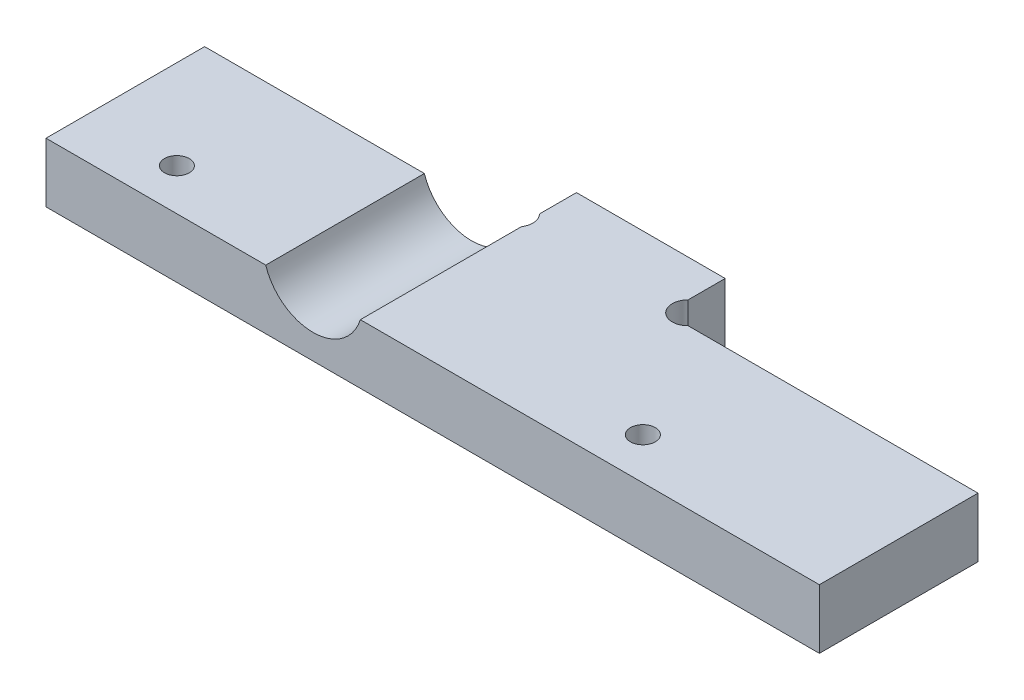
ISO-10303-21;
HEADER;
FILE_DESCRIPTION(('STEP AP214'),'2;1');
FILE_NAME('part.step','',(''),(''),'','','');
FILE_SCHEMA(('AUTOMOTIVE_DESIGN { 1 0 10303 214 1 1 1 1 }'));
ENDSEC;
DATA;
#1=APPLICATION_CONTEXT('core data for automotive mechanical design processes');
#2=APPLICATION_PROTOCOL_DEFINITION('international standard','automotive_design',2000,#1);
#3=PRODUCT_CONTEXT('',#1,'mechanical');
#4=PRODUCT('Part','Part','',(#3));
#5=PRODUCT_RELATED_PRODUCT_CATEGORY('part','',(#4));
#6=PRODUCT_DEFINITION_FORMATION('','',#4);
#7=PRODUCT_DEFINITION_CONTEXT('part definition',#1,'design');
#8=PRODUCT_DEFINITION('design','',#6,#7);
#9=PRODUCT_DEFINITION_SHAPE('','',#8);
#10=(LENGTH_UNIT() NAMED_UNIT(*) SI_UNIT(.MILLI.,.METRE.));
#11=(NAMED_UNIT(*) PLANE_ANGLE_UNIT() SI_UNIT($,.RADIAN.));
#12=(NAMED_UNIT(*) SI_UNIT($,.STERADIAN.) SOLID_ANGLE_UNIT());
#13=UNCERTAINTY_MEASURE_WITH_UNIT(LENGTH_MEASURE(1.E-05),#10,'distance_accuracy_value','');
#14=(GEOMETRIC_REPRESENTATION_CONTEXT(3) GLOBAL_UNCERTAINTY_ASSIGNED_CONTEXT((#13)) GLOBAL_UNIT_ASSIGNED_CONTEXT((#10,
#11,#12)) REPRESENTATION_CONTEXT('',''));
#15=CARTESIAN_POINT('',(0.,0.,0.));
#16=DIRECTION('',(0.,0.,1.));
#17=DIRECTION('',(1.,0.,0.));
#18=AXIS2_PLACEMENT_3D('',#15,#16,#17);
#19=CARTESIAN_POINT('',(30.3686291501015,6.,-17.1313708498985));
#20=DIRECTION('',(0.,1.,0.));
#21=DIRECTION('',(0.,0.,1.));
#22=AXIS2_PLACEMENT_3D('',#19,#20,#21);
#23=PLANE('',#22);
#24=DIRECTION('',(0.,0.,1.));
#25=VECTOR('',#24,1.);
#26=CARTESIAN_POINT('',(22.1641049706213,6.,-16.5));
#27=LINE('',#26,#25);
#28=CARTESIAN_POINT('',(22.1641049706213,6.,-16.));
#29=VERTEX_POINT('',#28);
#30=CARTESIAN_POINT('',(22.1641049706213,6.,0.));
#31=VERTEX_POINT('',#30);
#32=EDGE_CURVE('E53',#29,#31,#27,.T.);
#33=ORIENTED_EDGE('',*,*,#32,.F.);
#34=DIRECTION('',(-1.,0.,0.));
#35=VECTOR('',#34,1.);
#36=CARTESIAN_POINT('',(0.,6.,-16.));
#37=LINE('',#36,#35);
#38=CARTESIAN_POINT('',(0.,6.,-16.));
#39=VERTEX_POINT('',#38);
#40=EDGE_CURVE('E108',#29,#39,#37,.T.);
#41=ORIENTED_EDGE('',*,*,#40,.T.);
#42=DIRECTION('',(0.,0.,1.));
#43=VECTOR('',#42,1.);
#44=CARTESIAN_POINT('',(0.,6.,0.));
#45=LINE('',#44,#43);
#46=CARTESIAN_POINT('',(0.,6.,0.));
#47=VERTEX_POINT('',#46);
#48=EDGE_CURVE('E198',#39,#47,#45,.T.);
#49=ORIENTED_EDGE('',*,*,#48,.T.);
#50=DIRECTION('',(1.,0.,0.));
#51=VECTOR('',#50,1.);
#52=CARTESIAN_POINT('',(78.,6.,0.));
#53=LINE('',#52,#51);
#54=EDGE_CURVE('E220',#47,#31,#53,.T.);
#55=ORIENTED_EDGE('',*,*,#54,.T.);
#56=EDGE_LOOP('',(#33,#41,#49,#55));
#57=FACE_BOUND('',#56,.T.);
#58=CARTESIAN_POINT('',(9.,6.,-4.19999999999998));
#59=DIRECTION('',(0.,1.,0.));
#60=DIRECTION('',(0.,0.,1.));
#61=AXIS2_PLACEMENT_3D('',#58,#59,#60);
#62=CIRCLE('',#61,1.25);
#63=CARTESIAN_POINT('',(9.,6.,-2.94999999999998));
#64=VERTEX_POINT('',#63);
#65=EDGE_CURVE('E233',#64,#64,#62,.T.);
#66=ORIENTED_EDGE('',*,*,#65,.F.);
#67=EDGE_LOOP('',(#66));
#68=FACE_BOUND('',#67,.T.);
#69=ADVANCED_FACE('F37',(#57,#68),#23,.T.);
#70=DIRECTION('',(0.,0.,1.));
#71=VECTOR('',#70,1.);
#72=CARTESIAN_POINT('',(31.7034969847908,6.,-16.5));
#73=LINE('',#72,#71);
#74=CARTESIAN_POINT('',(31.7034969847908,6.,0.));
#75=VERTEX_POINT('',#74);
#76=CARTESIAN_POINT('',(31.7034969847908,6.,-16.2492552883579));
#77=VERTEX_POINT('',#76);
#78=EDGE_CURVE('E242',#75,#77,#73,.F.);
#79=ORIENTED_EDGE('',*,*,#78,.F.);
#80=CARTESIAN_POINT('',(78.,6.,0.));
#81=VERTEX_POINT('',#80);
#82=EDGE_CURVE('E224',#75,#81,#53,.T.);
#83=ORIENTED_EDGE('',*,*,#82,.T.);
#84=DIRECTION('',(0.,0.,-1.));
#85=VECTOR('',#84,1.);
#86=CARTESIAN_POINT('',(78.,6.,-16.));
#87=LINE('',#86,#85);
#88=CARTESIAN_POINT('',(78.,6.,-16.));
#89=VERTEX_POINT('',#88);
#90=EDGE_CURVE('E217',#81,#89,#87,.T.);
#91=ORIENTED_EDGE('',*,*,#90,.T.);
#92=DIRECTION('',(-1.,0.,0.));
#93=VECTOR('',#92,1.);
#94=CARTESIAN_POINT('',(48.7627416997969,6.,-16.));
#95=LINE('',#94,#93);
#96=CARTESIAN_POINT('',(48.7627416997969,6.,-16.));
#97=VERTEX_POINT('',#96);
#98=EDGE_CURVE('E219',#89,#97,#95,.T.);
#99=ORIENTED_EDGE('',*,*,#98,.T.);
#100=CARTESIAN_POINT('',(47.6313708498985,6.,-17.1313708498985));
#101=DIRECTION('',(0.,-1.,0.));
#102=DIRECTION('',(0.,0.,-1.));
#103=AXIS2_PLACEMENT_3D('',#100,#101,#102);
#104=CIRCLE('',#103,1.6);
#105=CARTESIAN_POINT('',(46.5,6.,-18.262741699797));
#106=VERTEX_POINT('',#105);
#107=EDGE_CURVE('E136',#97,#106,#104,.T.);
#108=ORIENTED_EDGE('',*,*,#107,.T.);
#109=DIRECTION('',(0.,0.,-1.));
#110=VECTOR('',#109,1.);
#111=CARTESIAN_POINT('',(46.5,6.,-22.));
#112=LINE('',#111,#110);
#113=CARTESIAN_POINT('',(46.5,6.,-22.));
#114=VERTEX_POINT('',#113);
#115=EDGE_CURVE('E127',#106,#114,#112,.T.);
#116=ORIENTED_EDGE('',*,*,#115,.T.);
#117=DIRECTION('',(-1.,0.,0.));
#118=VECTOR('',#117,1.);
#119=CARTESIAN_POINT('',(31.5,6.,-22.));
#120=LINE('',#119,#118);
#121=CARTESIAN_POINT('',(31.5,6.,-22.));
#122=VERTEX_POINT('',#121);
#123=EDGE_CURVE('E133',#114,#122,#120,.T.);
#124=ORIENTED_EDGE('',*,*,#123,.T.);
#125=DIRECTION('',(0.,0.,1.));
#126=VECTOR('',#125,1.);
#127=CARTESIAN_POINT('',(31.5,6.,-18.262741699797));
#128=LINE('',#127,#126);
#129=CARTESIAN_POINT('',(31.5,6.,-18.262741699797));
#130=VERTEX_POINT('',#129);
#131=EDGE_CURVE('E62',#122,#130,#128,.T.);
#132=ORIENTED_EDGE('',*,*,#131,.T.);
#133=CARTESIAN_POINT('',(30.3686291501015,6.,-17.1313708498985));
#134=DIRECTION('',(0.,-1.,0.));
#135=DIRECTION('',(0.,0.,1.));
#136=AXIS2_PLACEMENT_3D('',#133,#134,#135);
#137=CIRCLE('',#136,1.60000000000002);
#138=EDGE_CURVE('E177',#130,#77,#137,.T.);
#139=ORIENTED_EDGE('',*,*,#138,.T.);
#140=EDGE_LOOP('',(#79,#83,#91,#99,#108,#116,#124,#132,#139));
#141=FACE_BOUND('',#140,.T.);
#142=CARTESIAN_POINT('',(56.,6.,-4.19999999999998));
#143=DIRECTION('',(0.,1.,0.));
#144=DIRECTION('',(0.,0.,1.));
#145=AXIS2_PLACEMENT_3D('',#142,#143,#144);
#146=CIRCLE('',#145,1.25);
#147=CARTESIAN_POINT('',(56.,6.,-2.94999999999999));
#148=VERTEX_POINT('',#147);
#149=EDGE_CURVE('E161',#148,#148,#146,.T.);
#150=ORIENTED_EDGE('',*,*,#149,.F.);
#151=EDGE_LOOP('',(#150));
#152=FACE_BOUND('',#151,.T.);
#153=ADVANCED_FACE('F130',(#141,#152),#23,.T.);
#154=CARTESIAN_POINT('',(30.3686291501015,0.,-17.1313708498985));
#155=DIRECTION('',(0.,1.,0.));
#156=DIRECTION('',(0.,0.,1.));
#157=AXIS2_PLACEMENT_3D('',#154,#155,#156);
#158=PLANE('',#157);
#159=CARTESIAN_POINT('',(56.,0.,-4.19999999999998));
#160=DIRECTION('',(0.,1.,0.));
#161=DIRECTION('',(0.,0.,1.));
#162=AXIS2_PLACEMENT_3D('',#159,#160,#161);
#163=CIRCLE('',#162,1.25);
#164=CARTESIAN_POINT('',(56.,0.,-2.94999999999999));
#165=VERTEX_POINT('',#164);
#166=EDGE_CURVE('E230',#165,#165,#163,.T.);
#167=ORIENTED_EDGE('',*,*,#166,.T.);
#168=EDGE_LOOP('',(#167));
#169=FACE_BOUND('',#168,.T.);
#170=CARTESIAN_POINT('',(30.3686291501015,0.,-17.1313708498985));
#171=DIRECTION('',(0.,-1.,0.));
#172=DIRECTION('',(0.,0.,1.));
#173=AXIS2_PLACEMENT_3D('',#170,#171,#172);
#174=CIRCLE('',#173,1.60000000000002);
#175=CARTESIAN_POINT('',(31.5,0.,-18.262741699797));
#176=VERTEX_POINT('',#175);
#177=CARTESIAN_POINT('',(29.237258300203,0.,-16.));
#178=VERTEX_POINT('',#177);
#179=EDGE_CURVE('E157',#176,#178,#174,.T.);
#180=ORIENTED_EDGE('',*,*,#179,.F.);
#181=DIRECTION('',(0.,0.,1.));
#182=VECTOR('',#181,1.);
#183=CARTESIAN_POINT('',(31.5,0.,-18.262741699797));
#184=LINE('',#183,#182);
#185=CARTESIAN_POINT('',(31.5,0.,-22.));
#186=VERTEX_POINT('',#185);
#187=EDGE_CURVE('E100',#186,#176,#184,.T.);
#188=ORIENTED_EDGE('',*,*,#187,.F.);
#189=DIRECTION('',(-1.,0.,0.));
#190=VECTOR('',#189,1.);
#191=CARTESIAN_POINT('',(31.5,0.,-22.));
#192=LINE('',#191,#190);
#193=CARTESIAN_POINT('',(46.5,0.,-22.));
#194=VERTEX_POINT('',#193);
#195=EDGE_CURVE('E174',#194,#186,#192,.T.);
#196=ORIENTED_EDGE('',*,*,#195,.F.);
#197=DIRECTION('',(0.,0.,-1.));
#198=VECTOR('',#197,1.);
#199=CARTESIAN_POINT('',(46.5,0.,-22.));
#200=LINE('',#199,#198);
#201=CARTESIAN_POINT('',(46.5,0.,-18.262741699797));
#202=VERTEX_POINT('',#201);
#203=EDGE_CURVE('E145',#202,#194,#200,.T.);
#204=ORIENTED_EDGE('',*,*,#203,.F.);
#205=CARTESIAN_POINT('',(47.6313708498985,0.,-17.1313708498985));
#206=DIRECTION('',(0.,-1.,0.));
#207=DIRECTION('',(0.,0.,-1.));
#208=AXIS2_PLACEMENT_3D('',#205,#206,#207);
#209=CIRCLE('',#208,1.6);
#210=CARTESIAN_POINT('',(48.7627416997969,0.,-16.));
#211=VERTEX_POINT('',#210);
#212=EDGE_CURVE('E171',#211,#202,#209,.T.);
#213=ORIENTED_EDGE('',*,*,#212,.F.);
#214=DIRECTION('',(-1.,0.,0.));
#215=VECTOR('',#214,1.);
#216=CARTESIAN_POINT('',(48.7627416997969,0.,-16.));
#217=LINE('',#216,#215);
#218=CARTESIAN_POINT('',(78.,0.,-16.));
#219=VERTEX_POINT('',#218);
#220=EDGE_CURVE('E169',#219,#211,#217,.T.);
#221=ORIENTED_EDGE('',*,*,#220,.F.);
#222=DIRECTION('',(0.,0.,-1.));
#223=VECTOR('',#222,1.);
#224=CARTESIAN_POINT('',(78.,0.,-16.));
#225=LINE('',#224,#223);
#226=CARTESIAN_POINT('',(78.,0.,0.));
#227=VERTEX_POINT('',#226);
#228=EDGE_CURVE('E167',#227,#219,#225,.T.);
#229=ORIENTED_EDGE('',*,*,#228,.F.);
#230=DIRECTION('',(1.,0.,0.));
#231=VECTOR('',#230,1.);
#232=CARTESIAN_POINT('',(78.,0.,0.));
#233=LINE('',#232,#231);
#234=CARTESIAN_POINT('',(0.,0.,0.));
#235=VERTEX_POINT('',#234);
#236=EDGE_CURVE('E165',#235,#227,#233,.T.);
#237=ORIENTED_EDGE('',*,*,#236,.F.);
#238=DIRECTION('',(0.,0.,1.));
#239=VECTOR('',#238,1.);
#240=CARTESIAN_POINT('',(0.,0.,0.));
#241=LINE('',#240,#239);
#242=CARTESIAN_POINT('',(0.,0.,-16.));
#243=VERTEX_POINT('',#242);
#244=EDGE_CURVE('E163',#243,#235,#241,.T.);
#245=ORIENTED_EDGE('',*,*,#244,.F.);
#246=DIRECTION('',(-1.,0.,0.));
#247=VECTOR('',#246,1.);
#248=CARTESIAN_POINT('',(0.,0.,-16.));
#249=LINE('',#248,#247);
#250=EDGE_CURVE('E160',#178,#243,#249,.T.);
#251=ORIENTED_EDGE('',*,*,#250,.F.);
#252=EDGE_LOOP('',(#180,#188,#196,#204,#213,#221,#229,#237,#245,#251));
#253=FACE_BOUND('',#252,.T.);
#254=CARTESIAN_POINT('',(9.,0.,-4.19999999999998));
#255=DIRECTION('',(0.,1.,0.));
#256=DIRECTION('',(0.,0.,1.));
#257=AXIS2_PLACEMENT_3D('',#254,#255,#256);
#258=CIRCLE('',#257,1.25);
#259=CARTESIAN_POINT('',(9.,0.,-2.94999999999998));
#260=VERTEX_POINT('',#259);
#261=EDGE_CURVE('E236',#260,#260,#258,.T.);
#262=ORIENTED_EDGE('',*,*,#261,.T.);
#263=EDGE_LOOP('',(#262));
#264=FACE_BOUND('',#263,.T.);
#265=ADVANCED_FACE('F204',(#169,#253,#264),#158,.F.);
#266=CARTESIAN_POINT('',(30.3686291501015,6.,-17.1313708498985));
#267=DIRECTION('',(0.,-1.,0.));
#268=DIRECTION('',(0.,0.,-1.));
#269=AXIS2_PLACEMENT_3D('',#266,#267,#268);
#270=CYLINDRICAL_SURFACE('',#269,1.60000000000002);
#271=DIRECTION('',(0.,-1.,0.));
#272=VECTOR('',#271,1.);
#273=CARTESIAN_POINT('',(29.237258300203,6.,-16.));
#274=LINE('',#273,#272);
#275=CARTESIAN_POINT('',(29.237258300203,3.06219825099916,-16.));
#276=VERTEX_POINT('',#275);
#277=EDGE_CURVE('E11',#276,#178,#274,.T.);
#278=ORIENTED_EDGE('',*,*,#277,.F.);
#279=CARTESIAN_POINT('',(28.898469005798,2.90216577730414,-16.5));
#280=CARTESIAN_POINT('',(28.9155027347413,2.9094462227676,-16.4603180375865));
#281=CARTESIAN_POINT('',(28.9341025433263,2.91750403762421,-16.4214562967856));
#282=CARTESIAN_POINT('',(28.9741882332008,2.93521036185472,-16.3456441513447));
#283=CARTESIAN_POINT('',(28.9956732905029,2.94485841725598,-16.3086932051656));
#284=CARTESIAN_POINT('',(29.04120215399,2.96574343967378,-16.2370940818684));
#285=CARTESIAN_POINT('',(29.0652353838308,2.97697389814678,-16.2024372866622));
#286=CARTESIAN_POINT('',(29.11564187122,3.00107197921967,-16.1354885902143));
#287=CARTESIAN_POINT('',(29.1420151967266,3.01393964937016,-16.1031967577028));
#288=CARTESIAN_POINT('',(29.224178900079,3.05501413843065,-16.0101866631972));
#289=CARTESIAN_POINT('',(29.2830763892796,3.08572067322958,-15.9532355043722));
#290=CARTESIAN_POINT('',(29.4064834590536,3.1536445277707,-15.8504553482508));
#291=CARTESIAN_POINT('',(29.4709958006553,3.19086505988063,-15.8046318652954));
#292=CARTESIAN_POINT('',(29.606369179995,3.27342276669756,-15.7222793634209));
#293=CARTESIAN_POINT('',(29.6773864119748,3.31906958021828,-15.6863197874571));
#294=CARTESIAN_POINT('',(29.8202676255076,3.41639694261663,-15.6262725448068));
#295=CARTESIAN_POINT('',(29.8921321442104,3.4680815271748,-15.6021928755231));
#296=CARTESIAN_POINT('',(30.066783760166,3.60112612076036,-15.5564743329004));
#297=CARTESIAN_POINT('',(30.1689412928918,3.68537785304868,-15.5408043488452));
#298=CARTESIAN_POINT('',(30.366757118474,3.86234128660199,-15.5282915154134));
#299=CARTESIAN_POINT('',(30.4624055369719,3.95506536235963,-15.5314766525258));
#300=CARTESIAN_POINT('',(30.6836021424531,4.1872481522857,-15.557241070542));
#301=CARTESIAN_POINT('',(30.8048145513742,4.32996572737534,-15.5874110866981));
#302=CARTESIAN_POINT('',(31.0284944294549,4.6245802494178,-15.66889192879));
#303=CARTESIAN_POINT('',(31.1308546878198,4.77652353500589,-15.720318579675));
#304=CARTESIAN_POINT('',(31.3002679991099,5.05945779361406,-15.8274294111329));
#305=CARTESIAN_POINT('',(31.3703656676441,5.18952892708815,-15.8808399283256));
#306=CARTESIAN_POINT('',(31.4979168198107,5.45297752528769,-15.9946992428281));
#307=CARTESIAN_POINT('',(31.5553532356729,5.58635918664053,-16.0551573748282));
#308=CARTESIAN_POINT('',(31.6318154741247,5.78720329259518,-16.1485473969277));
#309=CARTESIAN_POINT('',(31.6555216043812,5.85369680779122,-16.179843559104));
#310=CARTESIAN_POINT('',(31.700011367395,5.98732154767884,-16.2431596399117));
#311=CARTESIAN_POINT('',(31.7207949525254,6.0544527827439,-16.2751795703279));
#312=CARTESIAN_POINT('',(31.7594261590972,6.18918132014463,-16.3394859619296));
#313=CARTESIAN_POINT('',(31.7772817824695,6.25677680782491,-16.371771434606));
#314=CARTESIAN_POINT('',(31.8101554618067,6.39273346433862,-16.4361575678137));
#315=CARTESIAN_POINT('',(31.8251737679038,6.46109456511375,-16.4682582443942));
#316=CARTESIAN_POINT('',(31.838789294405,6.52990226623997,-16.5));
#317=B_SPLINE_CURVE_WITH_KNOTS('',3,(#279,#280,#281,#282,#283,#284,#285,#286,#287,#288,#289,
#290,#291,#292,#293,#294,#295,#296,#297,#298,#299,#300,#301,#302,#303,#304,#305,#306,#307,#308,
#309,#310,#311,#312,#313,#314,#315,#316),.UNSPECIFIED.,.F.,.F.,(4,2,2,2,2,2,2,2,2,2,2,2,2,2,2,2,
2,2,4),(0.,0.131328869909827,0.262620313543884,0.393386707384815,0.524156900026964,
0.785340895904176,1.04665405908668,1.3208471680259,1.59522460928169,1.99300813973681,
2.39138224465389,2.9572415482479,3.52622567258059,3.99682812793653,4.46806114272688,
4.69967179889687,4.93128622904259,5.16225672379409,5.39320684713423),.UNSPECIFIED.);
#318=EDGE_CURVE('E245',#276,#77,#317,.T.);
#319=ORIENTED_EDGE('',*,*,#318,.T.);
#320=ORIENTED_EDGE('',*,*,#138,.F.);
#321=DIRECTION('',(0.,-1.,0.));
#322=VECTOR('',#321,1.);
#323=CARTESIAN_POINT('',(31.5,6.,-18.262741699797));
#324=LINE('',#323,#322);
#325=EDGE_CURVE('E153',#130,#176,#324,.T.);
#326=ORIENTED_EDGE('',*,*,#325,.T.);
#327=ORIENTED_EDGE('',*,*,#179,.T.);
#328=EDGE_LOOP('',(#278,#319,#320,#326,#327));
#329=FACE_BOUND('',#328,.T.);
#330=ADVANCED_FACE('F39',(#329),#270,.F.);
#331=CARTESIAN_POINT('',(0.,6.,-16.));
#332=DIRECTION('',(0.,0.,1.));
#333=DIRECTION('',(1.,0.,0.));
#334=AXIS2_PLACEMENT_3D('',#331,#332,#333);
#335=PLANE('',#334);
#336=ORIENTED_EDGE('',*,*,#40,.F.);
#337=CARTESIAN_POINT('',(26.933800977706,7.5,-16.));
#338=DIRECTION('',(0.,0.,1.));
#339=DIRECTION('',(1.,0.,0.));
#340=AXIS2_PLACEMENT_3D('',#337,#338,#339);
#341=CIRCLE('',#340,5.);
#342=EDGE_CURVE('E252',#29,#276,#341,.T.);
#343=ORIENTED_EDGE('',*,*,#342,.T.);
#344=ORIENTED_EDGE('',*,*,#277,.T.);
#345=ORIENTED_EDGE('',*,*,#250,.T.);
#346=DIRECTION('',(0.,-1.,0.));
#347=VECTOR('',#346,1.);
#348=CARTESIAN_POINT('',(0.,6.,-16.));
#349=LINE('',#348,#347);
#350=EDGE_CURVE('E46',#39,#243,#349,.T.);
#351=ORIENTED_EDGE('',*,*,#350,.F.);
#352=EDGE_LOOP('',(#336,#343,#344,#345,#351));
#353=FACE_BOUND('',#352,.T.);
#354=ADVANCED_FACE('F291',(#353),#335,.F.);
#355=CARTESIAN_POINT('',(0.,6.,0.));
#356=DIRECTION('',(1.,0.,0.));
#357=DIRECTION('',(0.,0.,-1.));
#358=AXIS2_PLACEMENT_3D('',#355,#356,#357);
#359=PLANE('',#358);
#360=ORIENTED_EDGE('',*,*,#244,.T.);
#361=DIRECTION('',(0.,-1.,0.));
#362=VECTOR('',#361,1.);
#363=CARTESIAN_POINT('',(0.,6.,0.));
#364=LINE('',#363,#362);
#365=EDGE_CURVE('E190',#47,#235,#364,.T.);
#366=ORIENTED_EDGE('',*,*,#365,.F.);
#367=ORIENTED_EDGE('',*,*,#48,.F.);
#368=ORIENTED_EDGE('',*,*,#350,.T.);
#369=EDGE_LOOP('',(#360,#366,#367,#368));
#370=FACE_BOUND('',#369,.T.);
#371=ADVANCED_FACE('F196',(#370),#359,.F.);
#372=CARTESIAN_POINT('',(78.,6.,0.));
#373=DIRECTION('',(0.,0.,-1.));
#374=DIRECTION('',(-1.,0.,0.));
#375=AXIS2_PLACEMENT_3D('',#372,#373,#374);
#376=PLANE('',#375);
#377=ORIENTED_EDGE('',*,*,#82,.F.);
#378=CARTESIAN_POINT('',(26.933800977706,7.5,0.));
#379=DIRECTION('',(0.,0.,1.));
#380=DIRECTION('',(1.,0.,0.));
#381=AXIS2_PLACEMENT_3D('',#378,#379,#380);
#382=CIRCLE('',#381,5.);
#383=EDGE_CURVE('E311',#31,#75,#382,.T.);
#384=ORIENTED_EDGE('',*,*,#383,.F.);
#385=ORIENTED_EDGE('',*,*,#54,.F.);
#386=ORIENTED_EDGE('',*,*,#365,.T.);
#387=ORIENTED_EDGE('',*,*,#236,.T.);
#388=DIRECTION('',(0.,-1.,0.));
#389=VECTOR('',#388,1.);
#390=CARTESIAN_POINT('',(78.,6.,0.));
#391=LINE('',#390,#389);
#392=EDGE_CURVE('E187',#81,#227,#391,.T.);
#393=ORIENTED_EDGE('',*,*,#392,.F.);
#394=EDGE_LOOP('',(#377,#384,#385,#386,#387,#393));
#395=FACE_BOUND('',#394,.T.);
#396=ADVANCED_FACE('F211',(#395),#376,.F.);
#397=CARTESIAN_POINT('',(78.,6.,-16.));
#398=DIRECTION('',(-1.,0.,0.));
#399=DIRECTION('',(0.,0.,1.));
#400=AXIS2_PLACEMENT_3D('',#397,#398,#399);
#401=PLANE('',#400);
#402=ORIENTED_EDGE('',*,*,#228,.T.);
#403=DIRECTION('',(0.,-1.,0.));
#404=VECTOR('',#403,1.);
#405=CARTESIAN_POINT('',(78.,6.,-16.));
#406=LINE('',#405,#404);
#407=EDGE_CURVE('E184',#89,#219,#406,.T.);
#408=ORIENTED_EDGE('',*,*,#407,.F.);
#409=ORIENTED_EDGE('',*,*,#90,.F.);
#410=ORIENTED_EDGE('',*,*,#392,.T.);
#411=EDGE_LOOP('',(#402,#408,#409,#410));
#412=FACE_BOUND('',#411,.T.);
#413=ADVANCED_FACE('F215',(#412),#401,.F.);
#414=CARTESIAN_POINT('',(48.7627416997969,6.,-16.));
#415=DIRECTION('',(0.,0.,1.));
#416=DIRECTION('',(1.,0.,0.));
#417=AXIS2_PLACEMENT_3D('',#414,#415,#416);
#418=PLANE('',#417);
#419=ORIENTED_EDGE('',*,*,#220,.T.);
#420=DIRECTION('',(0.,-1.,0.));
#421=VECTOR('',#420,1.);
#422=CARTESIAN_POINT('',(48.7627416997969,6.,-16.));
#423=LINE('',#422,#421);
#424=EDGE_CURVE('E181',#97,#211,#423,.T.);
#425=ORIENTED_EDGE('',*,*,#424,.F.);
#426=ORIENTED_EDGE('',*,*,#98,.F.);
#427=ORIENTED_EDGE('',*,*,#407,.T.);
#428=EDGE_LOOP('',(#419,#425,#426,#427));
#429=FACE_BOUND('',#428,.T.);
#430=ADVANCED_FACE('F281',(#429),#418,.F.);
#431=CARTESIAN_POINT('',(47.6313708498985,6.,-17.1313708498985));
#432=DIRECTION('',(0.,-1.,0.));
#433=DIRECTION('',(0.,0.,-1.));
#434=AXIS2_PLACEMENT_3D('',#431,#432,#433);
#435=CYLINDRICAL_SURFACE('',#434,1.6);
#436=ORIENTED_EDGE('',*,*,#212,.T.);
#437=DIRECTION('',(0.,-1.,0.));
#438=VECTOR('',#437,1.);
#439=CARTESIAN_POINT('',(46.5,6.,-18.262741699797));
#440=LINE('',#439,#438);
#441=EDGE_CURVE('E148',#106,#202,#440,.T.);
#442=ORIENTED_EDGE('',*,*,#441,.F.);
#443=ORIENTED_EDGE('',*,*,#107,.F.);
#444=ORIENTED_EDGE('',*,*,#424,.T.);
#445=EDGE_LOOP('',(#436,#442,#443,#444));
#446=FACE_BOUND('',#445,.T.);
#447=ADVANCED_FACE('F278',(#446),#435,.F.);
#448=CARTESIAN_POINT('',(46.5,6.,-22.));
#449=DIRECTION('',(-1.,0.,0.));
#450=DIRECTION('',(0.,0.,1.));
#451=AXIS2_PLACEMENT_3D('',#448,#449,#450);
#452=PLANE('',#451);
#453=ORIENTED_EDGE('',*,*,#203,.T.);
#454=DIRECTION('',(0.,-1.,0.));
#455=VECTOR('',#454,1.);
#456=CARTESIAN_POINT('',(46.5,6.,-22.));
#457=LINE('',#456,#455);
#458=EDGE_CURVE('E142',#114,#194,#457,.T.);
#459=ORIENTED_EDGE('',*,*,#458,.F.);
#460=ORIENTED_EDGE('',*,*,#115,.F.);
#461=ORIENTED_EDGE('',*,*,#441,.T.);
#462=EDGE_LOOP('',(#453,#459,#460,#461));
#463=FACE_BOUND('',#462,.T.);
#464=ADVANCED_FACE('F143',(#463),#452,.F.);
#465=CARTESIAN_POINT('',(31.5,6.,-22.));
#466=DIRECTION('',(0.,0.,1.));
#467=DIRECTION('',(1.,0.,0.));
#468=AXIS2_PLACEMENT_3D('',#465,#466,#467);
#469=PLANE('',#468);
#470=ORIENTED_EDGE('',*,*,#195,.T.);
#471=DIRECTION('',(0.,-1.,0.));
#472=VECTOR('',#471,1.);
#473=CARTESIAN_POINT('',(31.5,6.,-22.));
#474=LINE('',#473,#472);
#475=EDGE_CURVE('E149',#122,#186,#474,.T.);
#476=ORIENTED_EDGE('',*,*,#475,.F.);
#477=ORIENTED_EDGE('',*,*,#123,.F.);
#478=ORIENTED_EDGE('',*,*,#458,.T.);
#479=EDGE_LOOP('',(#470,#476,#477,#478));
#480=FACE_BOUND('',#479,.T.);
#481=ADVANCED_FACE('F151',(#480),#469,.F.);
#482=CARTESIAN_POINT('',(31.5,6.,-18.262741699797));
#483=DIRECTION('',(1.,0.,0.));
#484=DIRECTION('',(0.,0.,-1.));
#485=AXIS2_PLACEMENT_3D('',#482,#483,#484);
#486=PLANE('',#485);
#487=ORIENTED_EDGE('',*,*,#187,.T.);
#488=ORIENTED_EDGE('',*,*,#325,.F.);
#489=ORIENTED_EDGE('',*,*,#131,.F.);
#490=ORIENTED_EDGE('',*,*,#475,.T.);
#491=EDGE_LOOP('',(#487,#488,#489,#490));
#492=FACE_BOUND('',#491,.T.);
#493=ADVANCED_FACE('F265',(#492),#486,.F.);
#494=CARTESIAN_POINT('',(56.,6.,-4.19999999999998));
#495=DIRECTION('',(0.,-1.,0.));
#496=DIRECTION('',(0.,0.,-1.));
#497=AXIS2_PLACEMENT_3D('',#494,#495,#496);
#498=CYLINDRICAL_SURFACE('',#497,1.25);
#499=ORIENTED_EDGE('',*,*,#149,.T.);
#500=EDGE_LOOP('',(#499));
#501=FACE_BOUND('',#500,.T.);
#502=ORIENTED_EDGE('',*,*,#166,.F.);
#503=EDGE_LOOP('',(#502));
#504=FACE_BOUND('',#503,.T.);
#505=ADVANCED_FACE('F261',(#501,#504),#498,.F.);
#506=CARTESIAN_POINT('',(9.,6.,-4.19999999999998));
#507=DIRECTION('',(0.,-1.,0.));
#508=DIRECTION('',(0.,0.,-1.));
#509=AXIS2_PLACEMENT_3D('',#506,#507,#508);
#510=CYLINDRICAL_SURFACE('',#509,1.25);
#511=ORIENTED_EDGE('',*,*,#65,.T.);
#512=EDGE_LOOP('',(#511));
#513=FACE_BOUND('',#512,.T.);
#514=ORIENTED_EDGE('',*,*,#261,.F.);
#515=EDGE_LOOP('',(#514));
#516=FACE_BOUND('',#515,.T.);
#517=ADVANCED_FACE('F258',(#513,#516),#510,.F.);
#518=CARTESIAN_POINT('',(26.933800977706,7.5,-16.5));
#519=DIRECTION('',(0.,0.,1.));
#520=DIRECTION('',(1.,0.,0.));
#521=AXIS2_PLACEMENT_3D('',#518,#519,#520);
#522=CYLINDRICAL_SURFACE('',#521,5.);
#523=ORIENTED_EDGE('',*,*,#32,.T.);
#524=ORIENTED_EDGE('',*,*,#383,.T.);
#525=ORIENTED_EDGE('',*,*,#78,.T.);
#526=ORIENTED_EDGE('',*,*,#318,.F.);
#527=ORIENTED_EDGE('',*,*,#342,.F.);
#528=EDGE_LOOP('',(#523,#524,#525,#526,#527));
#529=FACE_BOUND('',#528,.T.);
#530=ADVANCED_FACE('F254',(#529),#522,.F.);
#531=CLOSED_SHELL('',(#69,#153,#265,#330,#354,#371,#396,#413,#430,#447,#464,#481,#493,#505,#517,#530));
#532=MANIFOLD_SOLID_BREP('B2',#531);
#533=ADVANCED_BREP_SHAPE_REPRESENTATION('',(#18,#532),#14);
#534=SHAPE_DEFINITION_REPRESENTATION(#9,#533);
ENDSEC;
END-ISO-10303-21;
